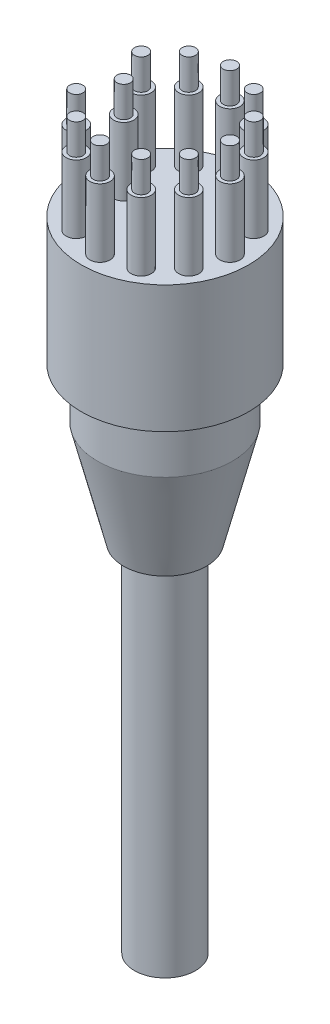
from build123d import *

# Parameters (mm, degrees)
SKETCH1_R         = 10.0584
EXTRUDE1_DEPTH    = 7.62
SKETCH3_R         = 12.5
EXTRUDE3_DEPTH    = 19
SKETCH7_R         = 1.5113
EXTRUDE5_DEPTH    = 10.16
SKETCH8_R         = 1.0033
EXTRUDE6_DEPTH    = 4.572
CIRPATTERN1_COUNT = 12
SKETCH11_R        = 1.5113
EXTRUDE9_DEPTH    = 10.16
SKETCH12_R        = 1.0033
EXTRUDE10_DEPTH   = 4.572
SKETCH4_R         = 10.0584
EXTRUDE4_DEPTH    = 15.5194
EXTRUDE4_TAPER    = 14
SKETCH5_R         = 4.572
CABLE_DEPTH       = 53.13125


with BuildPart() as part:
    # Sketch1 → Extrude1 (new body)
    with BuildSketch(Plane(origin=(0, 0, 0), x_dir=(1, 0, 0), z_dir=(0, 1, 0))):
        with Locations(Location((0, 0, 0), (0, 0, 90))):
            Circle(SKETCH1_R)
    extrude(amount=EXTRUDE1_DEPTH)

    # Sketch3 → Extrude3 (add)
    with BuildSketch(Plane(origin=(0, 7.62, 0), x_dir=(-1, 0, 0), z_dir=(0, 1, 0))):
        with Locations(Location((0, 0, 0), (0, 0, 90))):
            Circle(SKETCH3_R)
    extrude(amount=EXTRUDE3_DEPTH)

    # Sketch7 → Extrude5 (add)
    with BuildSketch(Plane(origin=(0, 26.62, 0), x_dir=(-1, 0, 0), z_dir=(0, 1, 0))):
        with Locations(Location((-9.70625, 0, 0), (0, 0, 90))):
            Circle(SKETCH7_R)
    extrude5 = extrude(amount=EXTRUDE5_DEPTH)

    # Sketch8 → Extrude6 (add)
    with BuildSketch(Plane(origin=(0, 36.78, 0), x_dir=(-1, 0, 0), z_dir=(0, 1, 0))):
        with Locations(Location((-9.70625, 0, 0), (0, 0, 90))):
            Circle(SKETCH8_R)
    extrude6 = extrude(amount=EXTRUDE6_DEPTH)

    # CirPattern1: Extrude5, Extrude6 ×12 about axis, 1 skipped
    cirpattern1_axis = Axis((0, 0, 0), (0, -1, 0))
    add([extrude5.rotate(cirpattern1_axis, i * 360 / CIRPATTERN1_COUNT) for i in range(1, CIRPATTERN1_COUNT) if i not in (6,)])
    add([extrude6.rotate(cirpattern1_axis, i * 360 / CIRPATTERN1_COUNT) for i in range(1, CIRPATTERN1_COUNT) if i not in (6,)])

    # Sketch11 → Extrude9 (add)
    with BuildSketch(Plane(origin=(0, 26.62, 0), x_dir=(1, 0, 0), z_dir=(0, 1, 0))):
        with Locations(Location((-6.167529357, 0, 0), (0, 0, 270))):
            Circle(SKETCH11_R)
    extrude(amount=EXTRUDE9_DEPTH)

    # Sketch12 → Extrude10 (add)
    with BuildSketch(Plane(origin=(0, 36.78, 0), x_dir=(1, 0, 0), z_dir=(0, 1, 0))):
        with Locations(Location((-6.167529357, 0, 0), (0, 0, 270))):
            Circle(SKETCH12_R)
    extrude(amount=EXTRUDE10_DEPTH)

    # Sketch4 → Extrude4 (add)
    with BuildSketch(Plane.XZ):
        with Locations(Location((0, 0, 0), (0, 0, 270))):
            Circle(SKETCH4_R)
    extrude(amount=EXTRUDE4_DEPTH, taper=EXTRUDE4_TAPER)

    # Sketch5 → Cable (add)
    with BuildSketch(Plane.XZ.offset(15.5194)):
        with Locations(Location((0, 0, 0), (0, 0, 270))):
            Circle(SKETCH5_R)
    extrude(amount=CABLE_DEPTH)


solid = part.part
